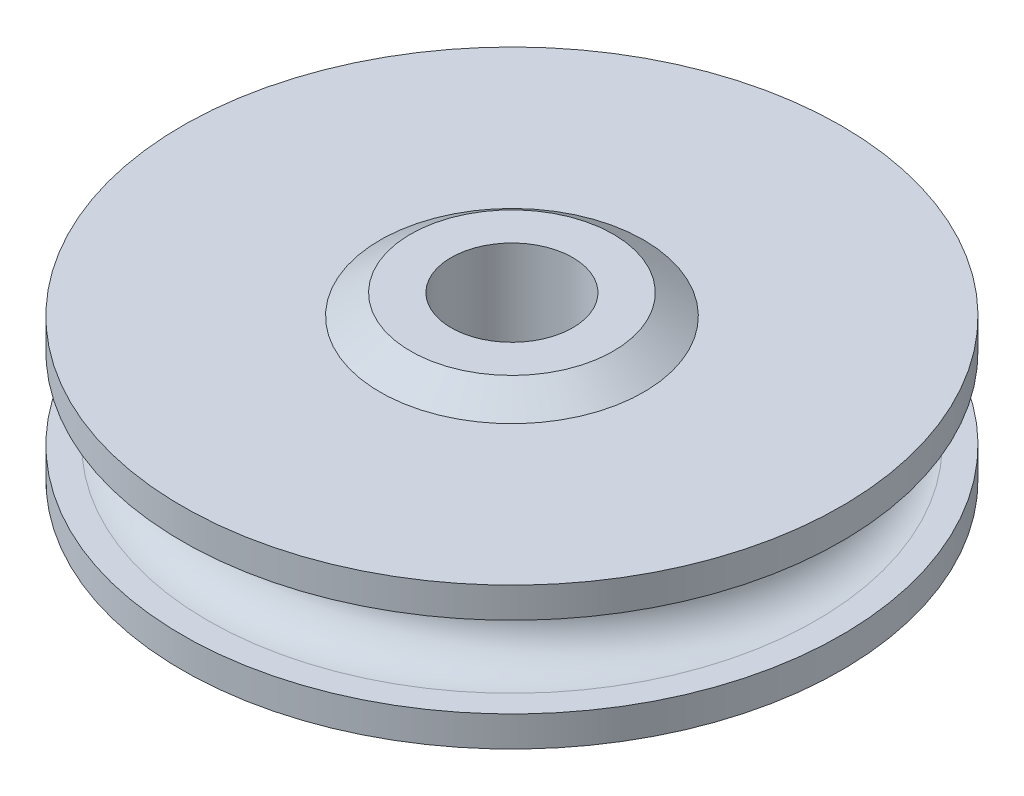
ISO-10303-21;
HEADER;
FILE_DESCRIPTION(('STEP AP214'),'2;1');
FILE_NAME('part.step','',(''),(''),'','','');
FILE_SCHEMA(('AUTOMOTIVE_DESIGN { 1 0 10303 214 1 1 1 1 }'));
ENDSEC;
DATA;
#1=APPLICATION_CONTEXT('core data for automotive mechanical design processes');
#2=APPLICATION_PROTOCOL_DEFINITION('international standard','automotive_design',2000,#1);
#3=PRODUCT_CONTEXT('',#1,'mechanical');
#4=PRODUCT('Part','Part','',(#3));
#5=PRODUCT_RELATED_PRODUCT_CATEGORY('part','',(#4));
#6=PRODUCT_DEFINITION_FORMATION('','',#4);
#7=PRODUCT_DEFINITION_CONTEXT('part definition',#1,'design');
#8=PRODUCT_DEFINITION('design','',#6,#7);
#9=PRODUCT_DEFINITION_SHAPE('','',#8);
#10=(LENGTH_UNIT() NAMED_UNIT(*) SI_UNIT(.MILLI.,.METRE.));
#11=(NAMED_UNIT(*) PLANE_ANGLE_UNIT() SI_UNIT($,.RADIAN.));
#12=(NAMED_UNIT(*) SI_UNIT($,.STERADIAN.) SOLID_ANGLE_UNIT());
#13=UNCERTAINTY_MEASURE_WITH_UNIT(LENGTH_MEASURE(1.E-05),#10,'distance_accuracy_value','');
#14=(GEOMETRIC_REPRESENTATION_CONTEXT(3) GLOBAL_UNCERTAINTY_ASSIGNED_CONTEXT((#13)) GLOBAL_UNIT_ASSIGNED_CONTEXT((#10,
#11,#12)) REPRESENTATION_CONTEXT('',''));
#15=CARTESIAN_POINT('',(0.,0.,0.));
#16=DIRECTION('',(0.,0.,1.));
#17=DIRECTION('',(1.,0.,0.));
#18=AXIS2_PLACEMENT_3D('',#15,#16,#17);
#19=CARTESIAN_POINT('',(0.,-9.00000000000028,0.));
#20=DIRECTION('',(0.,1.,0.));
#21=DIRECTION('',(0.,0.,1.));
#22=AXIS2_PLACEMENT_3D('',#19,#20,#21);
#23=CONICAL_SURFACE('',#22,10.0000000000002,0.98279372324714);
#24=CARTESIAN_POINT('',(0.,-6.99999999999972,0.));
#25=DIRECTION('',(0.,-1.,0.));
#26=DIRECTION('',(0.,0.,-1.));
#27=AXIS2_PLACEMENT_3D('',#24,#25,#26);
#28=CIRCLE('',#27,12.9999999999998);
#29=CARTESIAN_POINT('',(0.,-6.99999999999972,-12.9999999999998));
#30=VERTEX_POINT('',#29);
#31=EDGE_CURVE('E71',#30,#30,#28,.T.);
#32=ORIENTED_EDGE('',*,*,#31,.T.);
#33=EDGE_LOOP('',(#32));
#34=FACE_BOUND('',#33,.T.);
#35=CARTESIAN_POINT('',(0.,-9.00000000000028,0.));
#36=DIRECTION('',(0.,-1.,0.));
#37=DIRECTION('',(0.,0.,-1.));
#38=AXIS2_PLACEMENT_3D('',#35,#36,#37);
#39=CIRCLE('',#38,10.0000000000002);
#40=CARTESIAN_POINT('',(0.,-9.00000000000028,-10.0000000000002));
#41=VERTEX_POINT('',#40);
#42=EDGE_CURVE('E10',#41,#41,#39,.T.);
#43=ORIENTED_EDGE('',*,*,#42,.F.);
#44=EDGE_LOOP('',(#43));
#45=FACE_BOUND('',#44,.T.);
#46=ADVANCED_FACE('F31',(#34,#45),#23,.T.);
#47=CARTESIAN_POINT('',(6.,-9.00000000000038,0.));
#48=DIRECTION('',(0.,-1.,0.));
#49=DIRECTION('',(0.,0.,-1.));
#50=AXIS2_PLACEMENT_3D('',#47,#48,#49);
#51=PLANE('',#50);
#52=ORIENTED_EDGE('',*,*,#42,.T.);
#53=EDGE_LOOP('',(#52));
#54=FACE_BOUND('',#53,.T.);
#55=CARTESIAN_POINT('',(0.,-9.00000000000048,0.));
#56=DIRECTION('',(0.,-1.,0.));
#57=DIRECTION('',(0.,0.,-1.));
#58=AXIS2_PLACEMENT_3D('',#55,#56,#57);
#59=CIRCLE('',#58,6.);
#60=CARTESIAN_POINT('',(0.,-9.00000000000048,-6.));
#61=VERTEX_POINT('',#60);
#62=EDGE_CURVE('E37',#61,#61,#59,.T.);
#63=ORIENTED_EDGE('',*,*,#62,.F.);
#64=EDGE_LOOP('',(#63));
#65=FACE_BOUND('',#64,.T.);
#66=ADVANCED_FACE('F89',(#54,#65),#51,.T.);
#67=CARTESIAN_POINT('',(0.,9.00000000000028,0.));
#68=DIRECTION('',(0.,-1.,0.));
#69=DIRECTION('',(0.,0.,-1.));
#70=AXIS2_PLACEMENT_3D('',#67,#68,#69);
#71=CYLINDRICAL_SURFACE('',#70,6.);
#72=ORIENTED_EDGE('',*,*,#62,.T.);
#73=EDGE_LOOP('',(#72));
#74=FACE_BOUND('',#73,.T.);
#75=CARTESIAN_POINT('',(0.,8.99999999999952,0.));
#76=DIRECTION('',(0.,-1.,0.));
#77=DIRECTION('',(0.,0.,-1.));
#78=AXIS2_PLACEMENT_3D('',#75,#76,#77);
#79=CIRCLE('',#78,6.);
#80=CARTESIAN_POINT('',(0.,8.99999999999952,-6.));
#81=VERTEX_POINT('',#80);
#82=EDGE_CURVE('E41',#81,#81,#79,.T.);
#83=ORIENTED_EDGE('',*,*,#82,.F.);
#84=EDGE_LOOP('',(#83));
#85=FACE_BOUND('',#84,.T.);
#86=ADVANCED_FACE('F93',(#74,#85),#71,.F.);
#87=CARTESIAN_POINT('',(10.0000000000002,8.99999999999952,0.));
#88=DIRECTION('',(0.,1.,0.));
#89=DIRECTION('',(0.,0.,1.));
#90=AXIS2_PLACEMENT_3D('',#87,#88,#89);
#91=PLANE('',#90);
#92=ORIENTED_EDGE('',*,*,#82,.T.);
#93=EDGE_LOOP('',(#92));
#94=FACE_BOUND('',#93,.T.);
#95=CARTESIAN_POINT('',(0.,8.99999999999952,0.));
#96=DIRECTION('',(0.,-1.,0.));
#97=DIRECTION('',(0.,0.,-1.));
#98=AXIS2_PLACEMENT_3D('',#95,#96,#97);
#99=CIRCLE('',#98,10.0000000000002);
#100=CARTESIAN_POINT('',(0.,8.99999999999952,-10.0000000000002));
#101=VERTEX_POINT('',#100);
#102=EDGE_CURVE('E45',#101,#101,#99,.T.);
#103=ORIENTED_EDGE('',*,*,#102,.F.);
#104=EDGE_LOOP('',(#103));
#105=FACE_BOUND('',#104,.T.);
#106=ADVANCED_FACE('F97',(#94,#105),#91,.T.);
#107=CARTESIAN_POINT('',(0.,6.99999999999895,0.));
#108=DIRECTION('',(0.,-1.,0.));
#109=DIRECTION('',(0.,0.,-1.));
#110=AXIS2_PLACEMENT_3D('',#107,#108,#109);
#111=CONICAL_SURFACE('',#110,12.9999999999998,0.98279372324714);
#112=ORIENTED_EDGE('',*,*,#102,.T.);
#113=EDGE_LOOP('',(#112));
#114=FACE_BOUND('',#113,.T.);
#115=CARTESIAN_POINT('',(0.,6.99999999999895,0.));
#116=DIRECTION('',(0.,-1.,0.));
#117=DIRECTION('',(0.,0.,-1.));
#118=AXIS2_PLACEMENT_3D('',#115,#116,#117);
#119=CIRCLE('',#118,12.9999999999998);
#120=CARTESIAN_POINT('',(0.,6.99999999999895,-12.9999999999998));
#121=VERTEX_POINT('',#120);
#122=EDGE_CURVE('E50',#121,#121,#119,.T.);
#123=ORIENTED_EDGE('',*,*,#122,.F.);
#124=EDGE_LOOP('',(#123));
#125=FACE_BOUND('',#124,.T.);
#126=ADVANCED_FACE('F103',(#114,#125),#111,.T.);
#127=CARTESIAN_POINT('',(32.5,6.99999999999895,0.));
#128=DIRECTION('',(0.,1.,0.));
#129=DIRECTION('',(0.,0.,1.));
#130=AXIS2_PLACEMENT_3D('',#127,#128,#129);
#131=PLANE('',#130);
#132=ORIENTED_EDGE('',*,*,#122,.T.);
#133=EDGE_LOOP('',(#132));
#134=FACE_BOUND('',#133,.T.);
#135=CARTESIAN_POINT('',(0.,6.99999999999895,0.));
#136=DIRECTION('',(0.,-1.,0.));
#137=DIRECTION('',(0.,0.,-1.));
#138=AXIS2_PLACEMENT_3D('',#135,#136,#137);
#139=CIRCLE('',#138,32.5);
#140=CARTESIAN_POINT('',(0.,6.99999999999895,-32.5));
#141=VERTEX_POINT('',#140);
#142=EDGE_CURVE('E53',#141,#141,#139,.T.);
#143=ORIENTED_EDGE('',*,*,#142,.F.);
#144=EDGE_LOOP('',(#143));
#145=FACE_BOUND('',#144,.T.);
#146=ADVANCED_FACE('F107',(#134,#145),#131,.T.);
#147=CARTESIAN_POINT('',(0.,9.00000000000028,0.));
#148=DIRECTION('',(0.,-1.,0.));
#149=DIRECTION('',(0.,0.,-1.));
#150=AXIS2_PLACEMENT_3D('',#147,#148,#149);
#151=CYLINDRICAL_SURFACE('',#150,32.5);
#152=ORIENTED_EDGE('',*,*,#142,.T.);
#153=EDGE_LOOP('',(#152));
#154=FACE_BOUND('',#153,.T.);
#155=CARTESIAN_POINT('',(0.,4.,0.));
#156=DIRECTION('',(0.,-1.,0.));
#157=DIRECTION('',(0.,0.,-1.));
#158=AXIS2_PLACEMENT_3D('',#155,#156,#157);
#159=CIRCLE('',#158,32.5);
#160=CARTESIAN_POINT('',(0.,4.,-32.5));
#161=VERTEX_POINT('',#160);
#162=EDGE_CURVE('E56',#161,#161,#159,.T.);
#163=ORIENTED_EDGE('',*,*,#162,.F.);
#164=EDGE_LOOP('',(#163));
#165=FACE_BOUND('',#164,.T.);
#166=ADVANCED_FACE('F111',(#154,#165),#151,.T.);
#167=CARTESIAN_POINT('',(30.,4.,0.));
#168=DIRECTION('',(0.,-1.,0.));
#169=DIRECTION('',(0.,0.,-1.));
#170=AXIS2_PLACEMENT_3D('',#167,#168,#169);
#171=PLANE('',#170);
#172=ORIENTED_EDGE('',*,*,#162,.T.);
#173=EDGE_LOOP('',(#172));
#174=FACE_BOUND('',#173,.T.);
#175=CARTESIAN_POINT('',(0.,4.,0.));
#176=DIRECTION('',(0.,-1.,0.));
#177=DIRECTION('',(0.,0.,-1.));
#178=AXIS2_PLACEMENT_3D('',#175,#176,#177);
#179=CIRCLE('',#178,30.);
#180=CARTESIAN_POINT('',(0.,4.,-30.));
#181=VERTEX_POINT('',#180);
#182=EDGE_CURVE('E59',#181,#181,#179,.T.);
#183=ORIENTED_EDGE('',*,*,#182,.F.);
#184=EDGE_LOOP('',(#183));
#185=FACE_BOUND('',#184,.T.);
#186=ADVANCED_FACE('F115',(#174,#185),#171,.T.);
#187=CARTESIAN_POINT('',(0.,0.,0.));
#188=DIRECTION('',(0.,-1.,0.));
#189=DIRECTION('',(0.,0.,-1.));
#190=AXIS2_PLACEMENT_3D('',#187,#188,#189);
#191=TOROIDAL_SURFACE('',#190,30.,4.);
#192=ORIENTED_EDGE('',*,*,#182,.T.);
#193=EDGE_LOOP('',(#192));
#194=FACE_BOUND('',#193,.T.);
#195=CARTESIAN_POINT('',(0.,-4.,0.));
#196=DIRECTION('',(0.,-1.,0.));
#197=DIRECTION('',(0.,0.,-1.));
#198=AXIS2_PLACEMENT_3D('',#195,#196,#197);
#199=CIRCLE('',#198,30.);
#200=CARTESIAN_POINT('',(0.,-4.,-30.));
#201=VERTEX_POINT('',#200);
#202=EDGE_CURVE('E62',#201,#201,#199,.T.);
#203=ORIENTED_EDGE('',*,*,#202,.F.);
#204=EDGE_LOOP('',(#203));
#205=FACE_BOUND('',#204,.T.);
#206=ADVANCED_FACE('F119',(#194,#205),#191,.F.);
#207=CARTESIAN_POINT('',(32.5,-4.,0.));
#208=DIRECTION('',(0.,1.,0.));
#209=DIRECTION('',(0.,0.,1.));
#210=AXIS2_PLACEMENT_3D('',#207,#208,#209);
#211=PLANE('',#210);
#212=ORIENTED_EDGE('',*,*,#202,.T.);
#213=EDGE_LOOP('',(#212));
#214=FACE_BOUND('',#213,.T.);
#215=CARTESIAN_POINT('',(0.,-4.,0.));
#216=DIRECTION('',(0.,-1.,0.));
#217=DIRECTION('',(0.,0.,-1.));
#218=AXIS2_PLACEMENT_3D('',#215,#216,#217);
#219=CIRCLE('',#218,32.5);
#220=CARTESIAN_POINT('',(0.,-4.,-32.5));
#221=VERTEX_POINT('',#220);
#222=EDGE_CURVE('E65',#221,#221,#219,.T.);
#223=ORIENTED_EDGE('',*,*,#222,.F.);
#224=EDGE_LOOP('',(#223));
#225=FACE_BOUND('',#224,.T.);
#226=ADVANCED_FACE('F85',(#214,#225),#211,.T.);
#227=CARTESIAN_POINT('',(0.,9.00000000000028,0.));
#228=DIRECTION('',(0.,-1.,0.));
#229=DIRECTION('',(0.,0.,-1.));
#230=AXIS2_PLACEMENT_3D('',#227,#228,#229);
#231=CYLINDRICAL_SURFACE('',#230,32.5);
#232=ORIENTED_EDGE('',*,*,#222,.T.);
#233=EDGE_LOOP('',(#232));
#234=FACE_BOUND('',#233,.T.);
#235=CARTESIAN_POINT('',(0.,-7.,0.));
#236=DIRECTION('',(0.,-1.,0.));
#237=DIRECTION('',(0.,0.,-1.));
#238=AXIS2_PLACEMENT_3D('',#235,#236,#237);
#239=CIRCLE('',#238,32.5);
#240=CARTESIAN_POINT('',(0.,-7.,-32.5));
#241=VERTEX_POINT('',#240);
#242=EDGE_CURVE('E68',#241,#241,#239,.T.);
#243=ORIENTED_EDGE('',*,*,#242,.F.);
#244=EDGE_LOOP('',(#243));
#245=FACE_BOUND('',#244,.T.);
#246=ADVANCED_FACE('F79',(#234,#245),#231,.T.);
#247=CARTESIAN_POINT('',(12.9999999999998,-6.99999999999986,0.));
#248=DIRECTION('',(0.,-1.,0.));
#249=DIRECTION('',(0.,0.,-1.));
#250=AXIS2_PLACEMENT_3D('',#247,#248,#249);
#251=PLANE('',#250);
#252=ORIENTED_EDGE('',*,*,#242,.T.);
#253=EDGE_LOOP('',(#252));
#254=FACE_BOUND('',#253,.T.);
#255=ORIENTED_EDGE('',*,*,#31,.F.);
#256=EDGE_LOOP('',(#255));
#257=FACE_BOUND('',#256,.T.);
#258=ADVANCED_FACE('F77',(#254,#257),#251,.T.);
#259=CLOSED_SHELL('',(#46,#66,#86,#106,#126,#146,#166,#186,#206,#226,#246,#258));
#260=MANIFOLD_SOLID_BREP('B2',#259);
#261=ADVANCED_BREP_SHAPE_REPRESENTATION('',(#18,#260),#14);
#262=SHAPE_DEFINITION_REPRESENTATION(#9,#261);
ENDSEC;
END-ISO-10303-21;
